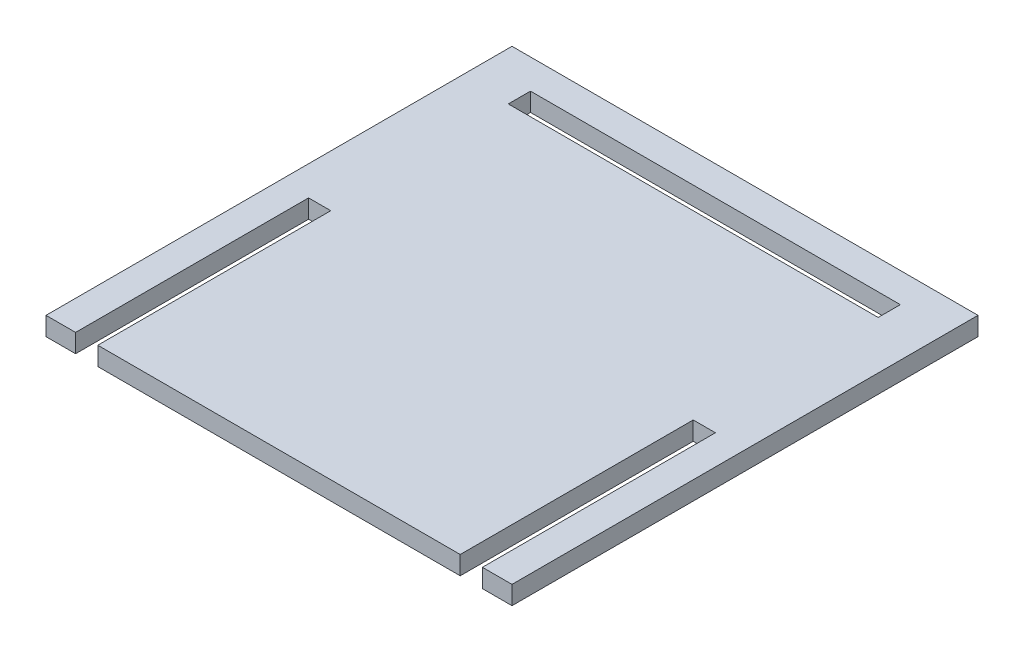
from build123d import *

# Parameters (mm, degrees)
SKETCH1_W           = 50
SKETCH1_H           = 3
BOSS_EXTRUDE1_DEPTH = 2.5


with BuildPart() as part:
    # Sketch1 → Boss-Extrude1 (new body)
    with BuildSketch(Plane(origin=(0, 0, 0), x_dir=(1, 0, 0), z_dir=(0, 1, 0))):
        Polygon((-27.5, -31.5), (-27.5, 0), (-24.5, 0), (-24.5, -31.5), (24.5, -31.5), (24.5, 0), (27.5, 0), (27.5, -31.5), (31.5, -31.5), (31.5, 31.5), (-31.5, 31.5), (-31.5, -31.5), align=None)
        with Locations((0, 26)):
            Rectangle(SKETCH1_W, SKETCH1_H, mode=Mode.SUBTRACT)
    extrude(amount=BOSS_EXTRUDE1_DEPTH)


solid = part.part
